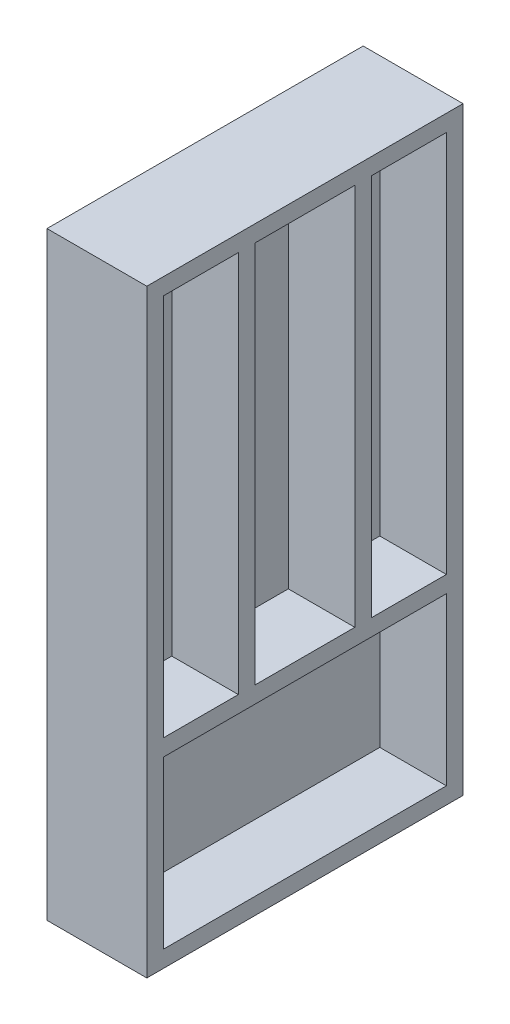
from build123d import *

# Parameters (mm, degrees)
SKETCH1_W           = 914.4
SKETCH1_H           = 482.6
BOSS_EXTRUDE1_DEPTH = 152.4
SKETCH2_W           = 863.6
SKETCH2_H           = 431.8
CUT_EXTRUDE1_DEPTH  = 101.6
SKETCH3_W           = 25.4
SKETCH3_H           = 431.8
SKETCH3_W_2         = 584.2
SKETCH3_H_2         = 25.4
BOSS_EXTRUDE2_DEPTH = 101.6


with BuildPart() as part:
    # Sketch1 → Boss-Extrude1 (new body)
    with BuildSketch(Plane.YZ):
        with Locations((457.2, 241.3)):
            Rectangle(SKETCH1_W, SKETCH1_H)
    extrude(amount=BOSS_EXTRUDE1_DEPTH)

    # Sketch2 → Cut-Extrude1 (cut)
    with BuildSketch(Plane.YZ.offset(152.4)):
        with Locations((457.2, 241.3)):
            Rectangle(SKETCH2_W, SKETCH2_H)
    extrude(amount=-CUT_EXTRUDE1_DEPTH, mode=Mode.SUBTRACT)

    # Sketch3 → Boss-Extrude2 (add)
    with BuildSketch(Plane.YZ.offset(50.8)):
        with Locations((292.1, 241.3)):
            Rectangle(SKETCH3_W, SKETCH3_H)
        with Locations((596.9, 330.2)):
            Rectangle(SKETCH3_W_2, SKETCH3_H_2)
        with Locations((596.9, 152.4)):
            Rectangle(SKETCH3_W_2, SKETCH3_H_2)
    extrude(amount=BOSS_EXTRUDE2_DEPTH)


solid = part.part
